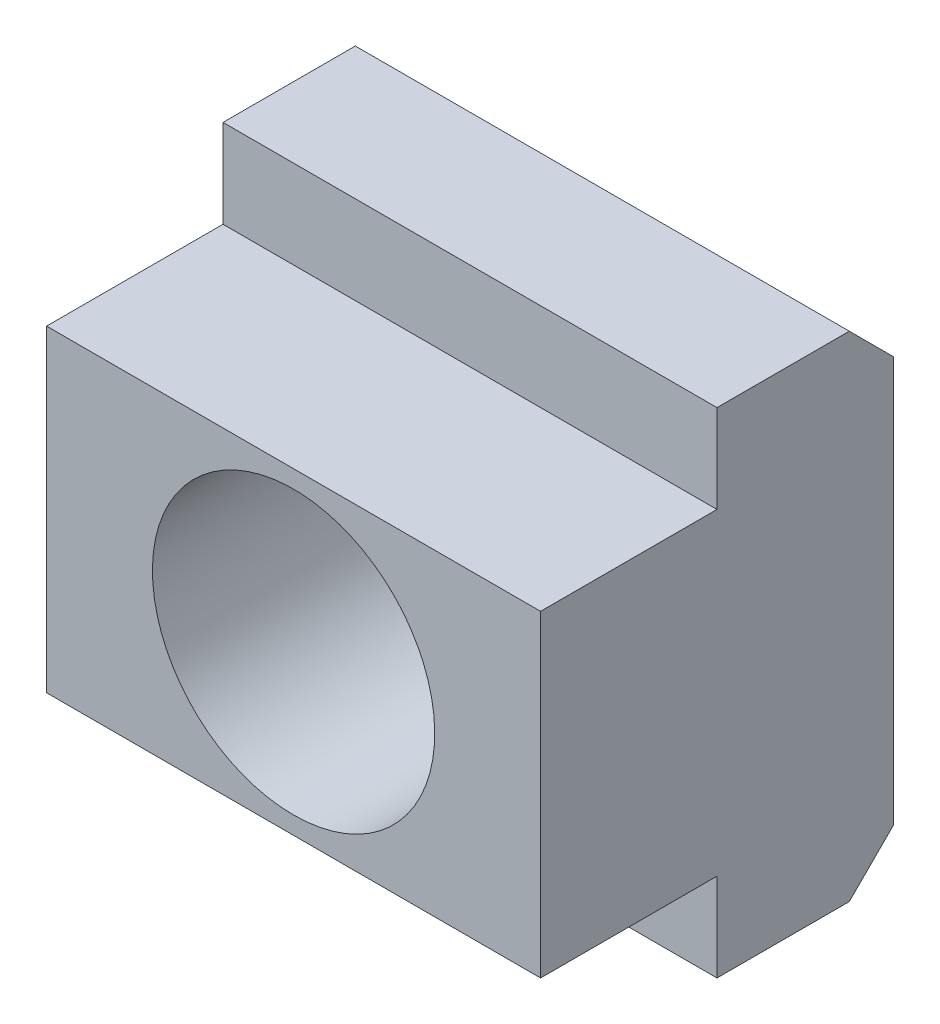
ISO-10303-21;
HEADER;
FILE_DESCRIPTION(('STEP AP214'),'2;1');
FILE_NAME('part.step','',(''),(''),'','','');
FILE_SCHEMA(('AUTOMOTIVE_DESIGN { 1 0 10303 214 1 1 1 1 }'));
ENDSEC;
DATA;
#1=APPLICATION_CONTEXT('core data for automotive mechanical design processes');
#2=APPLICATION_PROTOCOL_DEFINITION('international standard','automotive_design',2000,#1);
#3=PRODUCT_CONTEXT('',#1,'mechanical');
#4=PRODUCT('Part','Part','',(#3));
#5=PRODUCT_RELATED_PRODUCT_CATEGORY('part','',(#4));
#6=PRODUCT_DEFINITION_FORMATION('','',#4);
#7=PRODUCT_DEFINITION_CONTEXT('part definition',#1,'design');
#8=PRODUCT_DEFINITION('design','',#6,#7);
#9=PRODUCT_DEFINITION_SHAPE('','',#8);
#10=(LENGTH_UNIT() NAMED_UNIT(*) SI_UNIT(.MILLI.,.METRE.));
#11=(NAMED_UNIT(*) PLANE_ANGLE_UNIT() SI_UNIT($,.RADIAN.));
#12=(NAMED_UNIT(*) SI_UNIT($,.STERADIAN.) SOLID_ANGLE_UNIT());
#13=UNCERTAINTY_MEASURE_WITH_UNIT(LENGTH_MEASURE(1.E-05),#10,'distance_accuracy_value','');
#14=(GEOMETRIC_REPRESENTATION_CONTEXT(3) GLOBAL_UNCERTAINTY_ASSIGNED_CONTEXT((#13)) GLOBAL_UNIT_ASSIGNED_CONTEXT((#10,
#11,#12)) REPRESENTATION_CONTEXT('',''));
#15=CARTESIAN_POINT('',(0.,0.,0.));
#16=DIRECTION('',(0.,0.,1.));
#17=DIRECTION('',(1.,0.,0.));
#18=AXIS2_PLACEMENT_3D('',#15,#16,#17);
#19=CARTESIAN_POINT('',(14.,9.,10.));
#20=DIRECTION('',(0.,0.,-1.));
#21=DIRECTION('',(0.,1.,0.));
#22=AXIS2_PLACEMENT_3D('',#19,#20,#21);
#23=PLANE('',#22);
#24=DIRECTION('',(-1.,0.,0.));
#25=VECTOR('',#24,1.);
#26=CARTESIAN_POINT('',(14.,-9.,10.));
#27=LINE('',#26,#25);
#28=CARTESIAN_POINT('',(14.,-9.,10.));
#29=VERTEX_POINT('',#28);
#30=CARTESIAN_POINT('',(-14.,-9.,10.));
#31=VERTEX_POINT('',#30);
#32=EDGE_CURVE('E151',#29,#31,#27,.T.);
#33=ORIENTED_EDGE('',*,*,#32,.F.);
#34=DIRECTION('',(0.,-1.,0.));
#35=VECTOR('',#34,1.);
#36=CARTESIAN_POINT('',(14.,9.,10.));
#37=LINE('',#36,#35);
#38=CARTESIAN_POINT('',(14.,9.,10.));
#39=VERTEX_POINT('',#38);
#40=EDGE_CURVE('E130',#39,#29,#37,.T.);
#41=ORIENTED_EDGE('',*,*,#40,.F.);
#42=DIRECTION('',(-1.,0.,0.));
#43=VECTOR('',#42,1.);
#44=CARTESIAN_POINT('',(14.,9.,10.));
#45=LINE('',#44,#43);
#46=CARTESIAN_POINT('',(-14.,9.,10.));
#47=VERTEX_POINT('',#46);
#48=EDGE_CURVE('E153',#39,#47,#45,.T.);
#49=ORIENTED_EDGE('',*,*,#48,.T.);
#50=DIRECTION('',(0.,-1.,0.));
#51=VECTOR('',#50,1.);
#52=CARTESIAN_POINT('',(-14.,9.,10.));
#53=LINE('',#52,#51);
#54=EDGE_CURVE('E181',#47,#31,#53,.T.);
#55=ORIENTED_EDGE('',*,*,#54,.T.);
#56=EDGE_LOOP('',(#33,#41,#49,#55));
#57=FACE_BOUND('',#56,.T.);
#58=CARTESIAN_POINT('',(0.,0.,10.));
#59=DIRECTION('',(0.,0.,1.));
#60=DIRECTION('',(0.,-1.,0.));
#61=AXIS2_PLACEMENT_3D('',#58,#59,#60);
#62=CIRCLE('',#61,8.);
#63=CARTESIAN_POINT('',(0.,-8.,10.));
#64=VERTEX_POINT('',#63);
#65=EDGE_CURVE('E105',#64,#64,#62,.T.);
#66=ORIENTED_EDGE('',*,*,#65,.F.);
#67=EDGE_LOOP('',(#66));
#68=FACE_BOUND('',#67,.T.);
#69=ADVANCED_FACE('F14',(#57,#68),#23,.F.);
#70=CARTESIAN_POINT('',(14.,11.5,-10.));
#71=DIRECTION('',(0.,-0.707106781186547,0.707106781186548));
#72=DIRECTION('',(0.,-0.707106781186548,-0.707106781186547));
#73=AXIS2_PLACEMENT_3D('',#70,#71,#72);
#74=PLANE('',#73);
#75=DIRECTION('',(-1.,0.,0.));
#76=VECTOR('',#75,1.);
#77=CARTESIAN_POINT('',(14.,14.,-7.5));
#78=LINE('',#77,#76);
#79=CARTESIAN_POINT('',(14.,14.,-7.5));
#80=VERTEX_POINT('',#79);
#81=CARTESIAN_POINT('',(-14.,14.,-7.5));
#82=VERTEX_POINT('',#81);
#83=EDGE_CURVE('E9',#80,#82,#78,.T.);
#84=ORIENTED_EDGE('',*,*,#83,.F.);
#85=DIRECTION('',(0.,0.707106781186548,0.707106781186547));
#86=VECTOR('',#85,1.);
#87=CARTESIAN_POINT('',(14.,11.5,-10.));
#88=LINE('',#87,#86);
#89=CARTESIAN_POINT('',(14.,11.5,-10.));
#90=VERTEX_POINT('',#89);
#91=EDGE_CURVE('E140',#90,#80,#88,.T.);
#92=ORIENTED_EDGE('',*,*,#91,.F.);
#93=DIRECTION('',(-1.,0.,0.));
#94=VECTOR('',#93,1.);
#95=CARTESIAN_POINT('',(14.,11.5,-10.));
#96=LINE('',#95,#94);
#97=CARTESIAN_POINT('',(-14.,11.5,-10.));
#98=VERTEX_POINT('',#97);
#99=EDGE_CURVE('E29',#90,#98,#96,.T.);
#100=ORIENTED_EDGE('',*,*,#99,.T.);
#101=DIRECTION('',(0.,0.707106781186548,0.707106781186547));
#102=VECTOR('',#101,1.);
#103=CARTESIAN_POINT('',(-14.,11.5,-10.));
#104=LINE('',#103,#102);
#105=EDGE_CURVE('E101',#98,#82,#104,.T.);
#106=ORIENTED_EDGE('',*,*,#105,.T.);
#107=EDGE_LOOP('',(#84,#92,#100,#106));
#108=FACE_BOUND('',#107,.T.);
#109=ADVANCED_FACE('F102',(#108),#74,.F.);
#110=CARTESIAN_POINT('',(14.,14.,-7.5));
#111=DIRECTION('',(0.,-1.,0.));
#112=DIRECTION('',(0.,0.,-1.));
#113=AXIS2_PLACEMENT_3D('',#110,#111,#112);
#114=PLANE('',#113);
#115=DIRECTION('',(-1.,0.,0.));
#116=VECTOR('',#115,1.);
#117=CARTESIAN_POINT('',(14.,14.,0.));
#118=LINE('',#117,#116);
#119=CARTESIAN_POINT('',(14.,14.,0.));
#120=VERTEX_POINT('',#119);
#121=CARTESIAN_POINT('',(-14.,14.,0.));
#122=VERTEX_POINT('',#121);
#123=EDGE_CURVE('E22',#120,#122,#118,.T.);
#124=ORIENTED_EDGE('',*,*,#123,.F.);
#125=DIRECTION('',(0.,0.,1.));
#126=VECTOR('',#125,1.);
#127=CARTESIAN_POINT('',(14.,14.,-7.5));
#128=LINE('',#127,#126);
#129=EDGE_CURVE('E97',#80,#120,#128,.T.);
#130=ORIENTED_EDGE('',*,*,#129,.F.);
#131=ORIENTED_EDGE('',*,*,#83,.T.);
#132=DIRECTION('',(0.,0.,1.));
#133=VECTOR('',#132,1.);
#134=CARTESIAN_POINT('',(-14.,14.,-7.5));
#135=LINE('',#134,#133);
#136=EDGE_CURVE('E94',#82,#122,#135,.T.);
#137=ORIENTED_EDGE('',*,*,#136,.T.);
#138=EDGE_LOOP('',(#124,#130,#131,#137));
#139=FACE_BOUND('',#138,.T.);
#140=ADVANCED_FACE('F16',(#139),#114,.F.);
#141=CARTESIAN_POINT('',(14.,14.,0.));
#142=DIRECTION('',(0.,0.,-1.));
#143=DIRECTION('',(-1.,0.,0.));
#144=AXIS2_PLACEMENT_3D('',#141,#142,#143);
#145=PLANE('',#144);
#146=DIRECTION('',(-1.,0.,0.));
#147=VECTOR('',#146,1.);
#148=CARTESIAN_POINT('',(14.,9.,0.));
#149=LINE('',#148,#147);
#150=CARTESIAN_POINT('',(14.,9.,0.));
#151=VERTEX_POINT('',#150);
#152=CARTESIAN_POINT('',(-14.,9.,0.));
#153=VERTEX_POINT('',#152);
#154=EDGE_CURVE('E155',#151,#153,#149,.T.);
#155=ORIENTED_EDGE('',*,*,#154,.F.);
#156=DIRECTION('',(0.,-1.,0.));
#157=VECTOR('',#156,1.);
#158=CARTESIAN_POINT('',(14.,14.,0.));
#159=LINE('',#158,#157);
#160=EDGE_CURVE('E136',#120,#151,#159,.T.);
#161=ORIENTED_EDGE('',*,*,#160,.F.);
#162=ORIENTED_EDGE('',*,*,#123,.T.);
#163=DIRECTION('',(0.,-1.,0.));
#164=VECTOR('',#163,1.);
#165=CARTESIAN_POINT('',(-14.,14.,0.));
#166=LINE('',#165,#164);
#167=EDGE_CURVE('E110',#122,#153,#166,.T.);
#168=ORIENTED_EDGE('',*,*,#167,.T.);
#169=EDGE_LOOP('',(#155,#161,#162,#168));
#170=FACE_BOUND('',#169,.T.);
#171=ADVANCED_FACE('F158',(#170),#145,.F.);
#172=CARTESIAN_POINT('',(14.,9.,0.));
#173=DIRECTION('',(0.,-1.,0.));
#174=DIRECTION('',(0.,0.,-1.));
#175=AXIS2_PLACEMENT_3D('',#172,#173,#174);
#176=PLANE('',#175);
#177=ORIENTED_EDGE('',*,*,#48,.F.);
#178=DIRECTION('',(0.,0.,1.));
#179=VECTOR('',#178,1.);
#180=CARTESIAN_POINT('',(14.,9.,0.));
#181=LINE('',#180,#179);
#182=EDGE_CURVE('E133',#151,#39,#181,.T.);
#183=ORIENTED_EDGE('',*,*,#182,.F.);
#184=ORIENTED_EDGE('',*,*,#154,.T.);
#185=DIRECTION('',(0.,0.,1.));
#186=VECTOR('',#185,1.);
#187=CARTESIAN_POINT('',(-14.,9.,0.));
#188=LINE('',#187,#186);
#189=EDGE_CURVE('E112',#153,#47,#188,.T.);
#190=ORIENTED_EDGE('',*,*,#189,.T.);
#191=EDGE_LOOP('',(#177,#183,#184,#190));
#192=FACE_BOUND('',#191,.T.);
#193=ADVANCED_FACE('F186',(#192),#176,.F.);
#194=CARTESIAN_POINT('',(14.,-9.,10.));
#195=DIRECTION('',(0.,1.,0.));
#196=DIRECTION('',(0.,0.,1.));
#197=AXIS2_PLACEMENT_3D('',#194,#195,#196);
#198=PLANE('',#197);
#199=DIRECTION('',(-1.,0.,0.));
#200=VECTOR('',#199,1.);
#201=CARTESIAN_POINT('',(14.,-9.,0.));
#202=LINE('',#201,#200);
#203=CARTESIAN_POINT('',(14.,-9.,0.));
#204=VERTEX_POINT('',#203);
#205=CARTESIAN_POINT('',(-14.,-9.,0.));
#206=VERTEX_POINT('',#205);
#207=EDGE_CURVE('E149',#204,#206,#202,.T.);
#208=ORIENTED_EDGE('',*,*,#207,.F.);
#209=DIRECTION('',(0.,0.,-1.));
#210=VECTOR('',#209,1.);
#211=CARTESIAN_POINT('',(14.,-9.,10.));
#212=LINE('',#211,#210);
#213=EDGE_CURVE('E127',#29,#204,#212,.T.);
#214=ORIENTED_EDGE('',*,*,#213,.F.);
#215=ORIENTED_EDGE('',*,*,#32,.T.);
#216=DIRECTION('',(0.,0.,-1.));
#217=VECTOR('',#216,1.);
#218=CARTESIAN_POINT('',(-14.,-9.,10.));
#219=LINE('',#218,#217);
#220=EDGE_CURVE('E178',#31,#206,#219,.T.);
#221=ORIENTED_EDGE('',*,*,#220,.T.);
#222=EDGE_LOOP('',(#208,#214,#215,#221));
#223=FACE_BOUND('',#222,.T.);
#224=ADVANCED_FACE('F195',(#223),#198,.F.);
#225=CARTESIAN_POINT('',(14.,-9.,0.));
#226=DIRECTION('',(0.,0.,-1.));
#227=DIRECTION('',(-1.,0.,0.));
#228=AXIS2_PLACEMENT_3D('',#225,#226,#227);
#229=PLANE('',#228);
#230=DIRECTION('',(-1.,0.,0.));
#231=VECTOR('',#230,1.);
#232=CARTESIAN_POINT('',(14.,-14.,0.));
#233=LINE('',#232,#231);
#234=CARTESIAN_POINT('',(14.,-14.,0.));
#235=VERTEX_POINT('',#234);
#236=CARTESIAN_POINT('',(-14.,-14.,0.));
#237=VERTEX_POINT('',#236);
#238=EDGE_CURVE('E147',#235,#237,#233,.T.);
#239=ORIENTED_EDGE('',*,*,#238,.F.);
#240=DIRECTION('',(0.,-1.,0.));
#241=VECTOR('',#240,1.);
#242=CARTESIAN_POINT('',(14.,-9.,0.));
#243=LINE('',#242,#241);
#244=EDGE_CURVE('E124',#204,#235,#243,.T.);
#245=ORIENTED_EDGE('',*,*,#244,.F.);
#246=ORIENTED_EDGE('',*,*,#207,.T.);
#247=DIRECTION('',(0.,-1.,0.));
#248=VECTOR('',#247,1.);
#249=CARTESIAN_POINT('',(-14.,-9.,0.));
#250=LINE('',#249,#248);
#251=EDGE_CURVE('E175',#206,#237,#250,.T.);
#252=ORIENTED_EDGE('',*,*,#251,.T.);
#253=EDGE_LOOP('',(#239,#245,#246,#252));
#254=FACE_BOUND('',#253,.T.);
#255=ADVANCED_FACE('F197',(#254),#229,.F.);
#256=CARTESIAN_POINT('',(14.,-14.,0.));
#257=DIRECTION('',(0.,1.,0.));
#258=DIRECTION('',(0.,0.,1.));
#259=AXIS2_PLACEMENT_3D('',#256,#257,#258);
#260=PLANE('',#259);
#261=DIRECTION('',(-1.,0.,0.));
#262=VECTOR('',#261,1.);
#263=CARTESIAN_POINT('',(14.,-14.,-7.5));
#264=LINE('',#263,#262);
#265=CARTESIAN_POINT('',(14.,-14.,-7.5));
#266=VERTEX_POINT('',#265);
#267=CARTESIAN_POINT('',(-14.,-14.,-7.5));
#268=VERTEX_POINT('',#267);
#269=EDGE_CURVE('E145',#266,#268,#264,.T.);
#270=ORIENTED_EDGE('',*,*,#269,.F.);
#271=DIRECTION('',(0.,0.,-1.));
#272=VECTOR('',#271,1.);
#273=CARTESIAN_POINT('',(14.,-14.,0.));
#274=LINE('',#273,#272);
#275=EDGE_CURVE('E121',#235,#266,#274,.T.);
#276=ORIENTED_EDGE('',*,*,#275,.F.);
#277=ORIENTED_EDGE('',*,*,#238,.T.);
#278=DIRECTION('',(0.,0.,-1.));
#279=VECTOR('',#278,1.);
#280=CARTESIAN_POINT('',(-14.,-14.,0.));
#281=LINE('',#280,#279);
#282=EDGE_CURVE('E168',#237,#268,#281,.T.);
#283=ORIENTED_EDGE('',*,*,#282,.T.);
#284=EDGE_LOOP('',(#270,#276,#277,#283));
#285=FACE_BOUND('',#284,.T.);
#286=ADVANCED_FACE('F200',(#285),#260,.F.);
#287=CARTESIAN_POINT('',(14.,-14.,-7.5));
#288=DIRECTION('',(0.,0.707106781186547,0.707106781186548));
#289=DIRECTION('',(0.,-0.707106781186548,0.707106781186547));
#290=AXIS2_PLACEMENT_3D('',#287,#288,#289);
#291=PLANE('',#290);
#292=DIRECTION('',(-1.,0.,0.));
#293=VECTOR('',#292,1.);
#294=CARTESIAN_POINT('',(14.,-11.5,-10.));
#295=LINE('',#294,#293);
#296=CARTESIAN_POINT('',(14.,-11.5,-10.));
#297=VERTEX_POINT('',#296);
#298=CARTESIAN_POINT('',(-14.,-11.5,-10.));
#299=VERTEX_POINT('',#298);
#300=EDGE_CURVE('E37',#297,#299,#295,.T.);
#301=ORIENTED_EDGE('',*,*,#300,.F.);
#302=DIRECTION('',(0.,0.707106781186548,-0.707106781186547));
#303=VECTOR('',#302,1.);
#304=CARTESIAN_POINT('',(14.,-14.,-7.5));
#305=LINE('',#304,#303);
#306=EDGE_CURVE('E119',#266,#297,#305,.T.);
#307=ORIENTED_EDGE('',*,*,#306,.F.);
#308=ORIENTED_EDGE('',*,*,#269,.T.);
#309=DIRECTION('',(0.,0.707106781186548,-0.707106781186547));
#310=VECTOR('',#309,1.);
#311=CARTESIAN_POINT('',(-14.,-14.,-7.5));
#312=LINE('',#311,#310);
#313=EDGE_CURVE('E164',#268,#299,#312,.T.);
#314=ORIENTED_EDGE('',*,*,#313,.T.);
#315=EDGE_LOOP('',(#301,#307,#308,#314));
#316=FACE_BOUND('',#315,.T.);
#317=ADVANCED_FACE('F165',(#316),#291,.F.);
#318=CARTESIAN_POINT('',(14.,-11.5,-10.));
#319=DIRECTION('',(0.,0.,1.));
#320=DIRECTION('',(1.,0.,0.));
#321=AXIS2_PLACEMENT_3D('',#318,#319,#320);
#322=PLANE('',#321);
#323=CARTESIAN_POINT('',(0.,0.,-10.));
#324=DIRECTION('',(0.,0.,1.));
#325=DIRECTION('',(0.,-1.,0.));
#326=AXIS2_PLACEMENT_3D('',#323,#324,#325);
#327=CIRCLE('',#326,8.);
#328=CARTESIAN_POINT('',(0.,-8.,-10.));
#329=VERTEX_POINT('',#328);
#330=EDGE_CURVE('E319',#329,#329,#327,.T.);
#331=ORIENTED_EDGE('',*,*,#330,.T.);
#332=EDGE_LOOP('',(#331));
#333=FACE_BOUND('',#332,.T.);
#334=DIRECTION('',(0.,1.,0.));
#335=VECTOR('',#334,1.);
#336=CARTESIAN_POINT('',(14.,-11.5,-10.));
#337=LINE('',#336,#335);
#338=EDGE_CURVE('E116',#297,#90,#337,.T.);
#339=ORIENTED_EDGE('',*,*,#338,.F.);
#340=ORIENTED_EDGE('',*,*,#300,.T.);
#341=DIRECTION('',(0.,1.,0.));
#342=VECTOR('',#341,1.);
#343=CARTESIAN_POINT('',(-14.,-11.5,-10.));
#344=LINE('',#343,#342);
#345=EDGE_CURVE('E142',#299,#98,#344,.T.);
#346=ORIENTED_EDGE('',*,*,#345,.T.);
#347=ORIENTED_EDGE('',*,*,#99,.F.);
#348=EDGE_LOOP('',(#339,#340,#346,#347));
#349=FACE_BOUND('',#348,.T.);
#350=ADVANCED_FACE('F162',(#333,#349),#322,.F.);
#351=CARTESIAN_POINT('',(14.,0.,-21.5));
#352=DIRECTION('',(-1.,0.,0.));
#353=DIRECTION('',(0.,0.,1.));
#354=AXIS2_PLACEMENT_3D('',#351,#352,#353);
#355=PLANE('',#354);
#356=ORIENTED_EDGE('',*,*,#91,.T.);
#357=ORIENTED_EDGE('',*,*,#129,.T.);
#358=ORIENTED_EDGE('',*,*,#160,.T.);
#359=ORIENTED_EDGE('',*,*,#182,.T.);
#360=ORIENTED_EDGE('',*,*,#40,.T.);
#361=ORIENTED_EDGE('',*,*,#213,.T.);
#362=ORIENTED_EDGE('',*,*,#244,.T.);
#363=ORIENTED_EDGE('',*,*,#275,.T.);
#364=ORIENTED_EDGE('',*,*,#306,.T.);
#365=ORIENTED_EDGE('',*,*,#338,.T.);
#366=EDGE_LOOP('',(#356,#357,#358,#359,#360,#361,#362,#363,#364,#365));
#367=FACE_BOUND('',#366,.T.);
#368=ADVANCED_FACE('F160',(#367),#355,.F.);
#369=CARTESIAN_POINT('',(-14.,0.,-21.5));
#370=DIRECTION('',(-1.,0.,0.));
#371=DIRECTION('',(0.,0.,1.));
#372=AXIS2_PLACEMENT_3D('',#369,#370,#371);
#373=PLANE('',#372);
#374=ORIENTED_EDGE('',*,*,#105,.F.);
#375=ORIENTED_EDGE('',*,*,#345,.F.);
#376=ORIENTED_EDGE('',*,*,#313,.F.);
#377=ORIENTED_EDGE('',*,*,#282,.F.);
#378=ORIENTED_EDGE('',*,*,#251,.F.);
#379=ORIENTED_EDGE('',*,*,#220,.F.);
#380=ORIENTED_EDGE('',*,*,#54,.F.);
#381=ORIENTED_EDGE('',*,*,#189,.F.);
#382=ORIENTED_EDGE('',*,*,#167,.F.);
#383=ORIENTED_EDGE('',*,*,#136,.F.);
#384=EDGE_LOOP('',(#374,#375,#376,#377,#378,#379,#380,#381,#382,#383));
#385=FACE_BOUND('',#384,.T.);
#386=ADVANCED_FACE('F107',(#385),#373,.T.);
#387=CARTESIAN_POINT('',(0.,0.,10.));
#388=DIRECTION('',(0.,0.,1.));
#389=DIRECTION('',(0.,-1.,0.));
#390=AXIS2_PLACEMENT_3D('',#387,#388,#389);
#391=CYLINDRICAL_SURFACE('',#390,8.);
#392=ORIENTED_EDGE('',*,*,#65,.T.);
#393=EDGE_LOOP('',(#392));
#394=FACE_BOUND('',#393,.T.);
#395=ORIENTED_EDGE('',*,*,#330,.F.);
#396=EDGE_LOOP('',(#395));
#397=FACE_BOUND('',#396,.T.);
#398=ADVANCED_FACE('F285',(#394,#397),#391,.F.);
#399=CLOSED_SHELL('',(#69,#109,#140,#171,#193,#224,#255,#286,#317,#350,#368,#386,#398));
#400=MANIFOLD_SOLID_BREP('B1',#399);
#401=ADVANCED_BREP_SHAPE_REPRESENTATION('',(#18,#400),#14);
#402=SHAPE_DEFINITION_REPRESENTATION(#9,#401);
ENDSEC;
END-ISO-10303-21;
